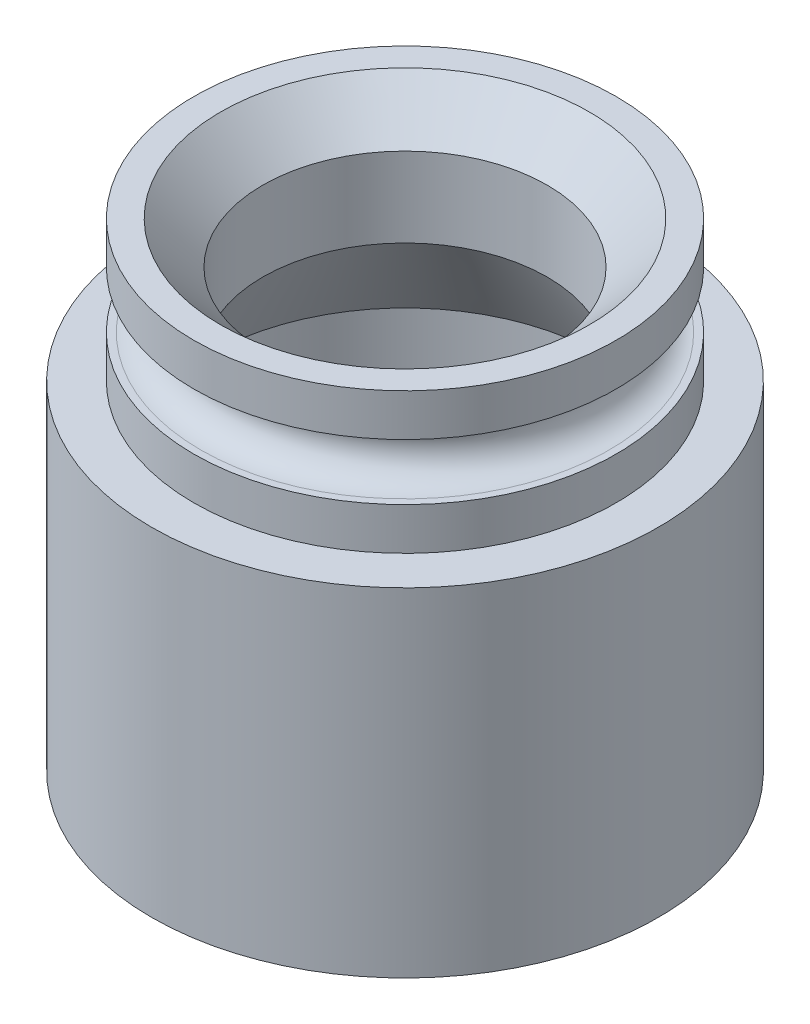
ISO-10303-21;
HEADER;
FILE_DESCRIPTION(('STEP AP214'),'2;1');
FILE_NAME('part.step','',(''),(''),'','','');
FILE_SCHEMA(('AUTOMOTIVE_DESIGN { 1 0 10303 214 1 1 1 1 }'));
ENDSEC;
DATA;
#1=APPLICATION_CONTEXT('core data for automotive mechanical design processes');
#2=APPLICATION_PROTOCOL_DEFINITION('international standard','automotive_design',2000,#1);
#3=PRODUCT_CONTEXT('',#1,'mechanical');
#4=PRODUCT('Part','Part','',(#3));
#5=PRODUCT_RELATED_PRODUCT_CATEGORY('part','',(#4));
#6=PRODUCT_DEFINITION_FORMATION('','',#4);
#7=PRODUCT_DEFINITION_CONTEXT('part definition',#1,'design');
#8=PRODUCT_DEFINITION('design','',#6,#7);
#9=PRODUCT_DEFINITION_SHAPE('','',#8);
#10=(LENGTH_UNIT() NAMED_UNIT(*) SI_UNIT(.MILLI.,.METRE.));
#11=(NAMED_UNIT(*) PLANE_ANGLE_UNIT() SI_UNIT($,.RADIAN.));
#12=(NAMED_UNIT(*) SI_UNIT($,.STERADIAN.) SOLID_ANGLE_UNIT());
#13=UNCERTAINTY_MEASURE_WITH_UNIT(LENGTH_MEASURE(1.E-05),#10,'distance_accuracy_value','');
#14=(GEOMETRIC_REPRESENTATION_CONTEXT(3) GLOBAL_UNCERTAINTY_ASSIGNED_CONTEXT((#13)) GLOBAL_UNIT_ASSIGNED_CONTEXT((#10,
#11,#12)) REPRESENTATION_CONTEXT('',''));
#15=CARTESIAN_POINT('',(0.,0.,0.));
#16=DIRECTION('',(0.,0.,1.));
#17=DIRECTION('',(1.,0.,0.));
#18=AXIS2_PLACEMENT_3D('',#15,#16,#17);
#19=CARTESIAN_POINT('',(0.,0.5,0.));
#20=DIRECTION('',(0.,1.,0.));
#21=DIRECTION('',(0.,0.,1.));
#22=AXIS2_PLACEMENT_3D('',#19,#20,#21);
#23=CYLINDRICAL_SURFACE('',#22,7.5);
#24=CARTESIAN_POINT('',(0.,-3.,0.));
#25=DIRECTION('',(0.,1.,0.));
#26=DIRECTION('',(0.,0.,1.));
#27=AXIS2_PLACEMENT_3D('',#24,#25,#26);
#28=CIRCLE('',#27,7.5);
#29=CARTESIAN_POINT('',(0.,-3.,7.5));
#30=VERTEX_POINT('',#29);
#31=EDGE_CURVE('E41',#30,#30,#28,.T.);
#32=ORIENTED_EDGE('',*,*,#31,.T.);
#33=EDGE_LOOP('',(#32));
#34=FACE_BOUND('',#33,.T.);
#35=CARTESIAN_POINT('',(0.,-1.5,0.));
#36=DIRECTION('',(0.,1.,0.));
#37=DIRECTION('',(0.,0.,1.));
#38=AXIS2_PLACEMENT_3D('',#35,#36,#37);
#39=CIRCLE('',#38,7.5);
#40=CARTESIAN_POINT('',(0.,-1.5,7.5));
#41=VERTEX_POINT('',#40);
#42=EDGE_CURVE('E53',#41,#41,#39,.T.);
#43=ORIENTED_EDGE('',*,*,#42,.F.);
#44=EDGE_LOOP('',(#43));
#45=FACE_BOUND('',#44,.T.);
#46=ADVANCED_FACE('F12',(#34,#45),#23,.T.);
#47=CARTESIAN_POINT('',(0.,0.5,0.));
#48=DIRECTION('',(0.,1.,0.));
#49=DIRECTION('',(0.,0.,1.));
#50=AXIS2_PLACEMENT_3D('',#47,#48,#49);
#51=CIRCLE('',#50,7.5);
#52=CARTESIAN_POINT('',(0.,0.5,7.5));
#53=VERTEX_POINT('',#52);
#54=EDGE_CURVE('E56',#53,#53,#51,.T.);
#55=ORIENTED_EDGE('',*,*,#54,.T.);
#56=EDGE_LOOP('',(#55));
#57=FACE_BOUND('',#56,.T.);
#58=CARTESIAN_POINT('',(0.,2.,0.));
#59=DIRECTION('',(0.,1.,0.));
#60=DIRECTION('',(0.,0.,1.));
#61=AXIS2_PLACEMENT_3D('',#58,#59,#60);
#62=CIRCLE('',#61,7.5);
#63=CARTESIAN_POINT('',(0.,2.,7.5));
#64=VERTEX_POINT('',#63);
#65=EDGE_CURVE('E44',#64,#64,#62,.T.);
#66=ORIENTED_EDGE('',*,*,#65,.F.);
#67=EDGE_LOOP('',(#66));
#68=FACE_BOUND('',#67,.T.);
#69=ADVANCED_FACE('F60',(#57,#68),#23,.T.);
#70=CARTESIAN_POINT('',(0.,0.5,0.));
#71=DIRECTION('',(0.,1.,0.));
#72=DIRECTION('',(0.,0.,1.));
#73=AXIS2_PLACEMENT_3D('',#70,#71,#72);
#74=CYLINDRICAL_SURFACE('',#73,5.05);
#75=CARTESIAN_POINT('',(0.,0.5,0.));
#76=DIRECTION('',(0.,1.,0.));
#77=DIRECTION('',(0.,0.,1.));
#78=AXIS2_PLACEMENT_3D('',#75,#76,#77);
#79=CIRCLE('',#78,5.05);
#80=CARTESIAN_POINT('',(0.,0.5,5.05));
#81=VERTEX_POINT('',#80);
#82=EDGE_CURVE('E19',#81,#81,#79,.T.);
#83=ORIENTED_EDGE('',*,*,#82,.T.);
#84=EDGE_LOOP('',(#83));
#85=FACE_BOUND('',#84,.T.);
#86=CARTESIAN_POINT('',(0.,-2.32679491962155,0.));
#87=DIRECTION('',(0.,1.,0.));
#88=DIRECTION('',(0.,0.,1.));
#89=AXIS2_PLACEMENT_3D('',#86,#87,#88);
#90=CIRCLE('',#89,5.05);
#91=CARTESIAN_POINT('',(0.,-2.32679491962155,5.05));
#92=VERTEX_POINT('',#91);
#93=EDGE_CURVE('E23',#92,#92,#90,.T.);
#94=ORIENTED_EDGE('',*,*,#93,.F.);
#95=EDGE_LOOP('',(#94));
#96=FACE_BOUND('',#95,.T.);
#97=ADVANCED_FACE('F89',(#85,#96),#74,.F.);
#98=CARTESIAN_POINT('',(0.,-5.70429399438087,0.));
#99=DIRECTION('',(0.,-1.,0.));
#100=DIRECTION('',(0.,0.,-1.));
#101=AXIS2_PLACEMENT_3D('',#98,#99,#100);
#102=CONICAL_SURFACE('',#101,7.,0.523598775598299);
#103=ORIENTED_EDGE('',*,*,#93,.T.);
#104=EDGE_LOOP('',(#103));
#105=FACE_BOUND('',#104,.T.);
#106=CARTESIAN_POINT('',(0.,-5.70429399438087,0.));
#107=DIRECTION('',(0.,1.,0.));
#108=DIRECTION('',(0.,0.,1.));
#109=AXIS2_PLACEMENT_3D('',#106,#107,#108);
#110=CIRCLE('',#109,7.);
#111=CARTESIAN_POINT('',(0.,-5.70429399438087,7.));
#112=VERTEX_POINT('',#111);
#113=EDGE_CURVE('E27',#112,#112,#110,.T.);
#114=ORIENTED_EDGE('',*,*,#113,.F.);
#115=EDGE_LOOP('',(#114));
#116=FACE_BOUND('',#115,.T.);
#117=ADVANCED_FACE('F108',(#105,#116),#102,.F.);
#118=CARTESIAN_POINT('',(0.,0.5,0.));
#119=DIRECTION('',(0.,1.,0.));
#120=DIRECTION('',(0.,0.,1.));
#121=AXIS2_PLACEMENT_3D('',#118,#119,#120);
#122=CYLINDRICAL_SURFACE('',#121,7.);
#123=ORIENTED_EDGE('',*,*,#113,.T.);
#124=EDGE_LOOP('',(#123));
#125=FACE_BOUND('',#124,.T.);
#126=CARTESIAN_POINT('',(0.,-15.,0.));
#127=DIRECTION('',(0.,1.,0.));
#128=DIRECTION('',(0.,0.,1.));
#129=AXIS2_PLACEMENT_3D('',#126,#127,#128);
#130=CIRCLE('',#129,7.);
#131=CARTESIAN_POINT('',(0.,-15.,7.));
#132=VERTEX_POINT('',#131);
#133=EDGE_CURVE('E32',#132,#132,#130,.T.);
#134=ORIENTED_EDGE('',*,*,#133,.F.);
#135=EDGE_LOOP('',(#134));
#136=FACE_BOUND('',#135,.T.);
#137=ADVANCED_FACE('F104',(#125,#136),#122,.F.);
#138=CARTESIAN_POINT('',(-7.,-15.,0.));
#139=DIRECTION('',(0.,-1.,0.));
#140=DIRECTION('',(0.,0.,-1.));
#141=AXIS2_PLACEMENT_3D('',#138,#139,#140);
#142=PLANE('',#141);
#143=ORIENTED_EDGE('',*,*,#133,.T.);
#144=EDGE_LOOP('',(#143));
#145=FACE_BOUND('',#144,.T.);
#146=CARTESIAN_POINT('',(0.,-15.,0.));
#147=DIRECTION('',(0.,1.,0.));
#148=DIRECTION('',(0.,0.,1.));
#149=AXIS2_PLACEMENT_3D('',#146,#147,#148);
#150=CIRCLE('',#149,9.);
#151=CARTESIAN_POINT('',(0.,-15.,9.));
#152=VERTEX_POINT('',#151);
#153=EDGE_CURVE('E35',#152,#152,#150,.T.);
#154=ORIENTED_EDGE('',*,*,#153,.F.);
#155=EDGE_LOOP('',(#154));
#156=FACE_BOUND('',#155,.T.);
#157=ADVANCED_FACE('F100',(#145,#156),#142,.T.);
#158=CARTESIAN_POINT('',(0.,0.5,0.));
#159=DIRECTION('',(0.,1.,0.));
#160=DIRECTION('',(0.,0.,1.));
#161=AXIS2_PLACEMENT_3D('',#158,#159,#160);
#162=CYLINDRICAL_SURFACE('',#161,9.);
#163=ORIENTED_EDGE('',*,*,#153,.T.);
#164=EDGE_LOOP('',(#163));
#165=FACE_BOUND('',#164,.T.);
#166=CARTESIAN_POINT('',(0.,-3.,0.));
#167=DIRECTION('',(0.,1.,0.));
#168=DIRECTION('',(0.,0.,1.));
#169=AXIS2_PLACEMENT_3D('',#166,#167,#168);
#170=CIRCLE('',#169,9.);
#171=CARTESIAN_POINT('',(0.,-3.,9.));
#172=VERTEX_POINT('',#171);
#173=EDGE_CURVE('E38',#172,#172,#170,.T.);
#174=ORIENTED_EDGE('',*,*,#173,.F.);
#175=EDGE_LOOP('',(#174));
#176=FACE_BOUND('',#175,.T.);
#177=ADVANCED_FACE('F96',(#165,#176),#162,.T.);
#178=CARTESIAN_POINT('',(-9.,-3.,0.));
#179=DIRECTION('',(0.,1.,0.));
#180=DIRECTION('',(0.,0.,1.));
#181=AXIS2_PLACEMENT_3D('',#178,#179,#180);
#182=PLANE('',#181);
#183=ORIENTED_EDGE('',*,*,#173,.T.);
#184=EDGE_LOOP('',(#183));
#185=FACE_BOUND('',#184,.T.);
#186=ORIENTED_EDGE('',*,*,#31,.F.);
#187=EDGE_LOOP('',(#186));
#188=FACE_BOUND('',#187,.T.);
#189=ADVANCED_FACE('F93',(#185,#188),#182,.T.);
#190=CARTESIAN_POINT('',(-7.5,2.,0.));
#191=DIRECTION('',(0.,1.,0.));
#192=DIRECTION('',(0.,0.,1.));
#193=AXIS2_PLACEMENT_3D('',#190,#191,#192);
#194=PLANE('',#193);
#195=CARTESIAN_POINT('',(0.,2.,0.));
#196=DIRECTION('',(0.,1.,0.));
#197=DIRECTION('',(0.,0.,1.));
#198=AXIS2_PLACEMENT_3D('',#195,#196,#197);
#199=CIRCLE('',#198,6.55);
#200=CARTESIAN_POINT('',(0.,2.,6.55));
#201=VERTEX_POINT('',#200);
#202=EDGE_CURVE('E8',#201,#201,#199,.F.);
#203=ORIENTED_EDGE('',*,*,#202,.T.);
#204=EDGE_LOOP('',(#203));
#205=FACE_BOUND('',#204,.T.);
#206=ORIENTED_EDGE('',*,*,#65,.T.);
#207=EDGE_LOOP('',(#206));
#208=FACE_BOUND('',#207,.T.);
#209=ADVANCED_FACE('F67',(#205,#208),#194,.T.);
#210=CARTESIAN_POINT('',(0.,0.5,0.));
#211=DIRECTION('',(0.,1.,0.));
#212=DIRECTION('',(0.,0.,1.));
#213=AXIS2_PLACEMENT_3D('',#210,#211,#212);
#214=PLANE('',#213);
#215=ORIENTED_EDGE('',*,*,#54,.F.);
#216=EDGE_LOOP('',(#215));
#217=FACE_BOUND('',#216,.T.);
#218=CARTESIAN_POINT('',(0.,0.5,0.));
#219=DIRECTION('',(0.,1.,0.));
#220=DIRECTION('',(0.,0.,1.));
#221=AXIS2_PLACEMENT_3D('',#218,#219,#220);
#222=CIRCLE('',#221,7.25);
#223=CARTESIAN_POINT('',(0.,0.5,7.25));
#224=VERTEX_POINT('',#223);
#225=EDGE_CURVE('E47',#224,#224,#222,.T.);
#226=ORIENTED_EDGE('',*,*,#225,.T.);
#227=EDGE_LOOP('',(#226));
#228=FACE_BOUND('',#227,.T.);
#229=ADVANCED_FACE('F63',(#217,#228),#214,.F.);
#230=CARTESIAN_POINT('',(0.,-0.5,0.));
#231=DIRECTION('',(0.,1.,0.));
#232=DIRECTION('',(0.,0.,1.));
#233=AXIS2_PLACEMENT_3D('',#230,#231,#232);
#234=TOROIDAL_SURFACE('',#233,7.25,1.);
#235=CARTESIAN_POINT('',(0.,-1.5,0.));
#236=DIRECTION('',(0.,1.,0.));
#237=DIRECTION('',(0.,0.,1.));
#238=AXIS2_PLACEMENT_3D('',#235,#236,#237);
#239=CIRCLE('',#238,7.25);
#240=CARTESIAN_POINT('',(0.,-1.5,7.25));
#241=VERTEX_POINT('',#240);
#242=EDGE_CURVE('E50',#241,#241,#239,.T.);
#243=ORIENTED_EDGE('',*,*,#242,.T.);
#244=EDGE_LOOP('',(#243));
#245=FACE_BOUND('',#244,.T.);
#246=ORIENTED_EDGE('',*,*,#225,.F.);
#247=EDGE_LOOP('',(#246));
#248=FACE_BOUND('',#247,.T.);
#249=ADVANCED_FACE('F66',(#245,#248),#234,.F.);
#250=CARTESIAN_POINT('',(0.,-1.5,0.));
#251=DIRECTION('',(0.,1.,0.));
#252=DIRECTION('',(0.,0.,1.));
#253=AXIS2_PLACEMENT_3D('',#250,#251,#252);
#254=PLANE('',#253);
#255=ORIENTED_EDGE('',*,*,#42,.T.);
#256=EDGE_LOOP('',(#255));
#257=FACE_BOUND('',#256,.T.);
#258=ORIENTED_EDGE('',*,*,#242,.F.);
#259=EDGE_LOOP('',(#258));
#260=FACE_BOUND('',#259,.T.);
#261=ADVANCED_FACE('F72',(#257,#260),#254,.T.);
#262=CARTESIAN_POINT('',(0.,0.5,0.));
#263=DIRECTION('',(0.,1.,0.));
#264=DIRECTION('',(0.,0.,1.));
#265=AXIS2_PLACEMENT_3D('',#262,#263,#264);
#266=CONICAL_SURFACE('',#265,5.05,0.78539816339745);
#267=ORIENTED_EDGE('',*,*,#202,.F.);
#268=EDGE_LOOP('',(#267));
#269=FACE_BOUND('',#268,.T.);
#270=ORIENTED_EDGE('',*,*,#82,.F.);
#271=EDGE_LOOP('',(#270));
#272=FACE_BOUND('',#271,.T.);
#273=ADVANCED_FACE('F14',(#269,#272),#266,.F.);
#274=CLOSED_SHELL('',(#46,#69,#97,#117,#137,#157,#177,#189,#209,#229,#249,#261,#273));
#275=MANIFOLD_SOLID_BREP('B1',#274);
#276=ADVANCED_BREP_SHAPE_REPRESENTATION('',(#18,#275),#14);
#277=SHAPE_DEFINITION_REPRESENTATION(#9,#276);
ENDSEC;
END-ISO-10303-21;
